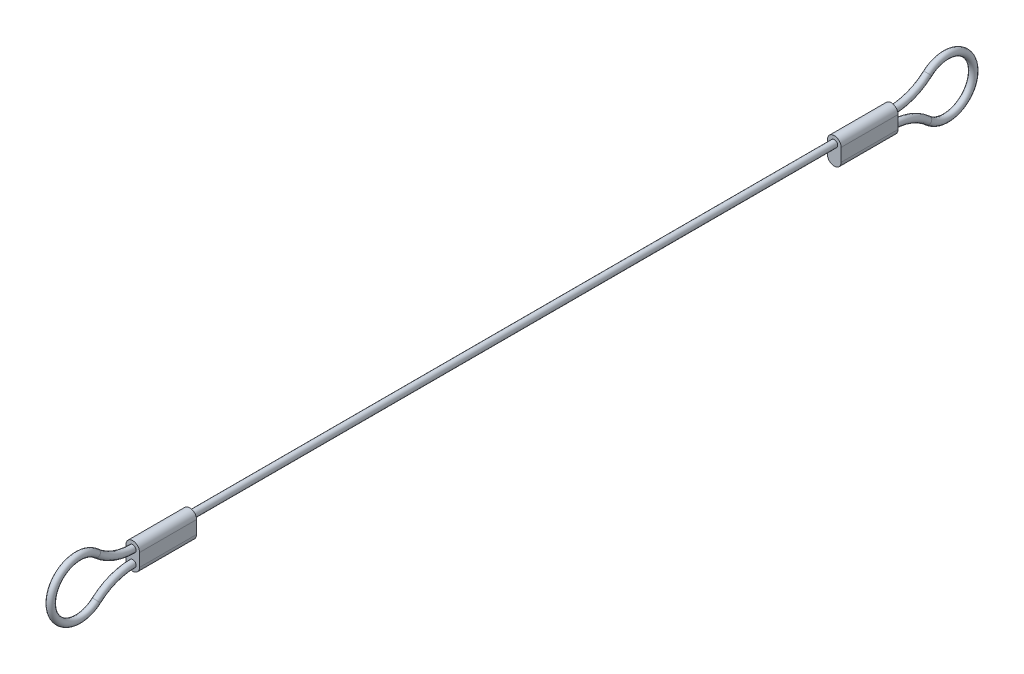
from build123d import *

# Parameters (mm, degrees)
SKETCH2_R           = 0.595
BOSS_EXTRUDE1_DEPTH = 10


with BuildPart() as part:
    # Sweep1: sweep along a path in Sketch1
    with BuildLine(Plane(origin=(0, 0, 0), x_dir=(0, 0, -1), z_dir=(1, 0, 0))) as sweep1_path:
        ThreePointArc((-66.6, -2.266252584), (-70.025492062, -2.898197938), (-73, -4.710835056))
        ThreePointArc((-73, -4.710835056), (-81, -1.133126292), (-73, 2.444582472))
        ThreePointArc((-73, 2.444582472), (-70.025492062, 0.631945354), (-66.6, 0))
        Line((-66.6, 0), (66.6, 0))
        ThreePointArc((66.6, 0), (70.025492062, 0.631945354), (73, 2.444582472))
        ThreePointArc((73, 2.444582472), (81, -1.133126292), (73, -4.710835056))
        ThreePointArc((73, -4.710835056), (70.025492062, -2.898197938), (66.6, -2.266252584))
    # Sketch2 → Sweep1 (sweep)
    with BuildSketch(Plane.XY):
        Circle(SKETCH2_R)
    sweep(path=sweep1_path.line)

    # Sketch3 → Boss-Extrude1 (add)
    with BuildSketch(Plane(origin=(0, 0, 66.6), x_dir=(-1, 0, 0), z_dir=(0, 0, -1))):
        with BuildLine():
            Line((1.2, 0), (1.2, -2.266252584))
            ThreePointArc((1.2, -2.266252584), (0, -3.466252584), (-1.2, -2.266252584))
            Line((-1.2, -2.266252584), (-1.2, 0))
            ThreePointArc((-1.2, 0), (0, 1.2), (1.2, 0))
        make_face()
    boss_extrude1 = extrude(amount=BOSS_EXTRUDE1_DEPTH)

    # Mirror1: Boss-Extrude1 across plane
    add(boss_extrude1.mirror(Plane.XY))


solid = part.part
